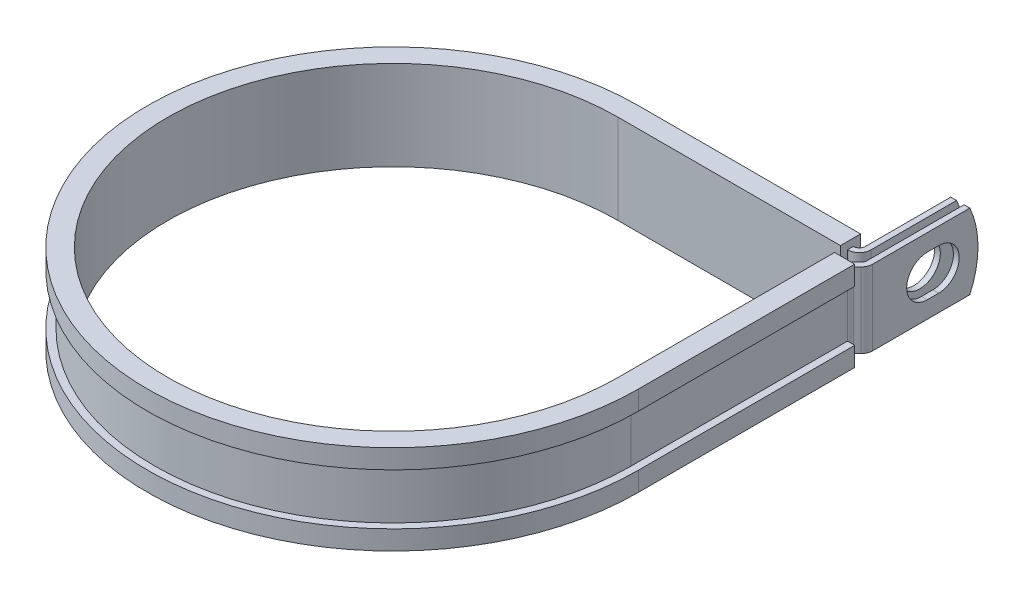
from build123d import *

# Parameters (mm, degrees)
EXTRUDE_THIN1_DEPTH = 7.9375
SKETCH2_R           = 4.3561
CUT_EXTRUDE1_DEPTH  = 1.2192
CUT_EXTRUDE2_DEPTH  = 1.2192
CUT_EXTRUDE3_DEPTH  = 123.026810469


with BuildPart() as part:
    # Sketch1 → Extrude-Thin1 (new, symmetric)
    with BuildSketch(Plane(origin=(0, 0, 0), x_dir=(1, 0, 0), z_dir=(0, 1, 0))):
        with BuildLine():
            Line((51.0464698, 71.4248), (51.0464698, 49.149))
            ThreePointArc((51.0464698, 49.149), (50.953663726, 48.682432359), (50.689374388, 48.286895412))
            Line((50.689374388, 48.286895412), (49.863190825, 47.460711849))
            ThreePointArc((49.863190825, 47.460711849), (49.334612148, 46.669637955), (49.149, 45.736502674))
            Line((49.149, 45.736502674), (49.149, 0))
            ThreePointArc((49.149, 0), (-34.753591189, -34.753591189), (0, 49.149))
            Line((0, 49.149), (47.0332698, 49.149))
            ThreePointArc((47.0332698, 49.149), (48.757478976, 49.863190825), (49.4716698, 51.5874))
            Line((49.4716698, 51.5874), (49.4716698, 71.4248))
            Line((49.4716698, 71.4248), (48.2524698, 71.4248))
            Line((48.2524698, 71.4248), (48.2524698, 51.5874))
            ThreePointArc((48.2524698, 51.5874), (47.895374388, 50.725295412), (47.0332698, 50.3682))
            Line((47.0332698, 50.3682), (0, 50.3682))
            ThreePointArc((0, 50.3682), (-35.615695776, -35.615695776), (50.3682, 0))
            Line((50.3682, 0), (50.3682, 45.736502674))
            ThreePointArc((50.3682, 45.736502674), (50.461006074, 46.203070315), (50.725295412, 46.598607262))
            Line((50.725295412, 46.598607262), (51.551478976, 47.424790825))
            ThreePointArc((51.551478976, 47.424790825), (52.080057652, 48.215864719), (52.2656698, 49.149))
            Line((52.2656698, 49.149), (52.2656698, 71.4248))
            Line((52.2656698, 71.4248), (51.0464698, 71.4248))
        make_face()
    extrude(amount=EXTRUDE_THIN1_DEPTH, both=True)

    # Sketch2 → Cut-Extrude1 (cut)
    with BuildSketch(Plane.ZY.offset(-48.2524698)):
        with Locations((-61.8998, 0)):
            Circle(SKETCH2_R)
    extrude(amount=-CUT_EXTRUDE1_DEPTH, mode=Mode.SUBTRACT)

    # Sketch3 → Cut-Extrude2 (cut)
    with BuildSketch(Plane(origin=(52.2656698, 0, 0), x_dir=(0, 0, -1), z_dir=(1, 0, 0))):
        with BuildLine():
            Line((60.706, 4.3561), (63.0936, 4.3561))
            ThreePointArc((63.0936, 4.3561), (67.4497, 0), (63.0936, -4.3561))
            Line((63.0936, -4.3561), (60.706, -4.3561))
            ThreePointArc((60.706, -4.3561), (56.3499, 0), (60.706, 4.3561))
        make_face()
    extrude(amount=-CUT_EXTRUDE2_DEPTH, mode=Mode.SUBTRACT)

    # Sketch4 → Cut-Extrude3 (cut, through all)
    with BuildSketch(Plane.ZY.offset(-48.2524698)):
        with BuildLine():
            Line((-69.692380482, 7.9375), (-71.4248, 7.9375))
            Line((-71.4248, 7.9375), (-71.4248, 0))
            ThreePointArc((-71.4248, 0), (-70.986656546, 4.062178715), (-69.692380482, 7.9375))
        make_face()
        with BuildLine():
            ThreePointArc((-69.692380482, -7.9375), (-70.986656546, -4.062178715), (-71.4248, 0))
            Line((-71.4248, 0), (-71.4248, -7.9375))
            Line((-71.4248, -7.9375), (-69.692380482, -7.9375))
        make_face()
    extrude(amount=-CUT_EXTRUDE3_DEPTH, mode=Mode.SUBTRACT)

    # Sweep1: sweep along a path in Sketch6
    with BuildLine(Plane(origin=(0, 7.9375, 0), x_dir=(1, 0, 0), z_dir=(0, 1, 0))) as sweep1_path:
        Line((47.625, 45.736502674), (47.625, 0))
        ThreePointArc((47.625, 0), (-33.675960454, -33.675960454), (0, 47.625))
        Line((0, 47.625), (46.9824698, 47.625))
    # Sketch5 → Sweep1 (sweep)
    with BuildSketch(Plane(origin=(0, 0, -45.736502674), x_dir=(-1, 0, 0), z_dir=(0, 0, -1))):
        Polygon((-50.3682, 7.9375), (-49.149, 7.9375), (-49.149, -7.9375), (-50.3682, -7.9375), (-50.3682, -5.3975), (-51.8922, -5.3975), (-51.8922, -9.4615), (-47.625, -9.4615), (-47.625, 9.4615), (-51.8922, 9.4615), (-51.8922, 5.3975), (-50.3682, 5.3975), align=None)
    sweep(path=sweep1_path.line)


solid = part.part
